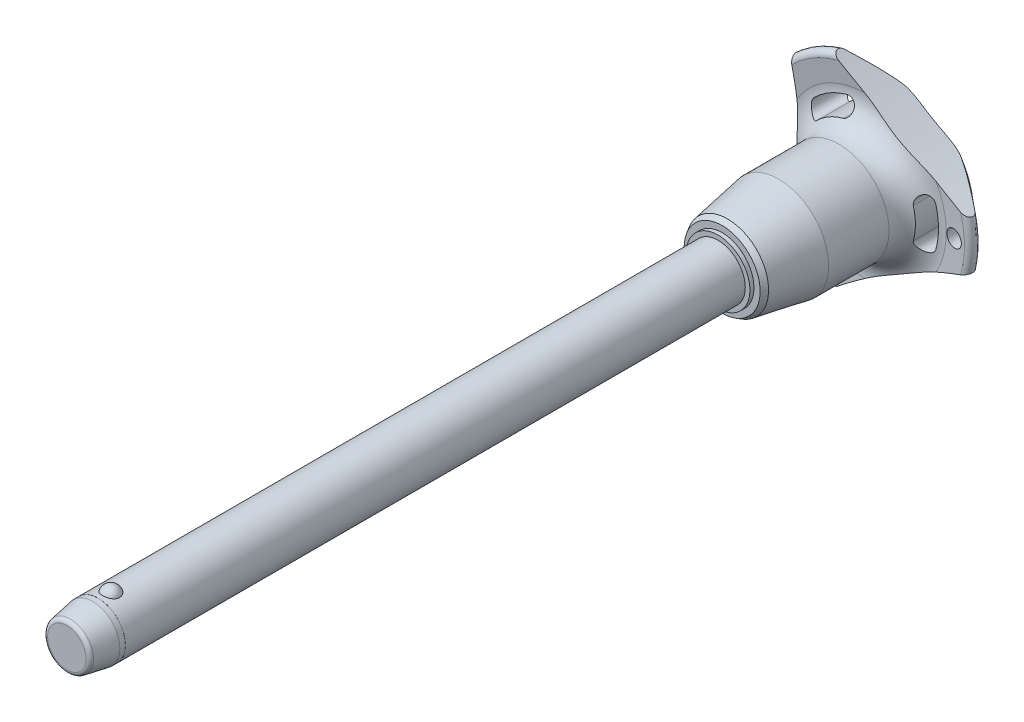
from build123d import *

# Parameters (mm, degrees)
SKETCH1_R           = 5
BOSS_EXTRUDE1_DEPTH = 110
SKETCH2_R           = 4.25
BOSS_EXTRUDE2_DEPTH = 33.3
BOSS_EXTRUDE3_START = 9.6
SKETCH1_2_R         = 5
BOSS_EXTRUDE3_DEPTH = 9.6
CHAMFER1_SIZE       = 4.8
CHAMFER1_SIZE2      = 0.846369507
FILLET1_R           = 0.75
SKETCH6_R           = 102.8
CUT_EXTRUDE1_DEPTH  = 146.959729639
CIRPATTERN1_COUNT   = 3
SKETCH7_R           = 1.5
CUT_EXTRUDE2_DEPTH  = 146.848877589
SKETCH8_R           = 5
SKETCH8_R_2         = 4.99
CUT_EXTRUDE3_DEPTH  = 5.76


with BuildPart() as part:
    # Sketch1 → Boss-Extrude1 (new body)
    with BuildSketch(Plane.XY):
        Circle(SKETCH1_R)
    extrude(amount=-BOSS_EXTRUDE1_DEPTH)

    # Sketch2 → Boss-Extrude2 (add)
    with BuildSketch(Plane(origin=(0, 0, -110), x_dir=(-1, 0, 0), z_dir=(0, 0, -1))):
        Circle(SKETCH2_R)
    extrude(amount=BOSS_EXTRUDE2_DEPTH)

    # Sketch3 → Revolve1 (revolve)
    with BuildSketch(Plane(origin=(0, 0, 0), x_dir=(0, 0, -1), z_dir=(1, 0, 0))):
        with BuildLine():
            Line((-1.516575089, 6), (-1.516575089, 2.7))
            ThreePointArc((-1.516575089, 2.7), (0.133424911, 4.35), (-1.516575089, 6))
        make_face()
        with BuildLine():
            Line((-1.516575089, -2.7), (-1.516575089, -6))
            ThreePointArc((-1.516575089, -6), (0.133424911, -4.35), (-1.516575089, -2.7))
        make_face()
    revolve(axis=Axis((0, -2.7, 1.516575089), (0, 1, 0)))

    # Sketch1_2 → Boss-Extrude3 (add)
    with BuildSketch(Plane.XY.offset(BOSS_EXTRUDE3_START)):
        Circle(SKETCH1_2_R)
    extrude(amount=-BOSS_EXTRUDE3_DEPTH)

    # Chamfer1
    chamfer1_edges = [part.edges().sort_by_distance(p)[0] for p in [
        (-5, 0, 9.6),
    ]]
    chamfer1_side = [part.faces().sort_by_distance(p)[0] for p in [
        (-5, 0, -50.2),
    ]]
    chamfer(chamfer1_edges, length=CHAMFER1_SIZE, length2=CHAMFER1_SIZE2, reference=chamfer1_side[0])

    # Fillet1
    fillet1_edges = [part.edges().sort_by_distance(p)[0] for p in [
        (-4.153630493, 0, 9.6),
        (4.25, 0, -143.3),
    ]]
    fillet(fillet1_edges, radius=FILLET1_R)

    # Sketch4 → Revolve2 (revolve)
    with BuildSketch(Plane(origin=(0, 0, 0), x_dir=(0, 0, -1), z_dir=(1, 0, 0)), mode=Mode.PRIVATE) as revolve2_sk:
        Polygon((110, 0), (110, 5.848880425), (110.75, 5.848880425), (110.75, 6.981619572), (111.730980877, 7.547989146), (121.1, 9.2), (132.2, 9.2), (132.2, 0), align=None)
    revolve(revolve2_sk.sketch.rotate(Axis((0, 0, -132.2), (0, 0, 1)), 90), axis=Axis((0, 0, -132.2), (0, 0, 1)))

    # Sketch5 → Revolve3 (revolve)
    with BuildSketch(Plane(origin=(0, 0, 0), x_dir=(0, 0, -1), z_dir=(1, 0, 0)), mode=Mode.PRIVATE) as revolve3_sk:
        with BuildLine():
            Line((137.169704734, 14.749576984), (136.756059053, 18.490084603))
            ThreePointArc((136.756059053, 18.490084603), (137.35677658, 19.519442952), (138.516044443, 19.24278761))
            Line((138.516044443, 19.24278761), (142.835691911, 14.094832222))
            ThreePointArc((142.835691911, 14.094832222), (143.3, 12.689260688), (142.67067517, 11.349423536))
            ThreePointArc((142.67067517, 11.349423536), (139.033110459, 6.185112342), (137.75, 0))
            Line((137.75, 0), (132.2, 0))
            Line((132.2, 0), (132.2, 9.2))
            ThreePointArc((132.2, 9.2), (135.924774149, 10.864425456), (137.169704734, 14.749576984))
        make_face()
    revolve(revolve3_sk.sketch.rotate(Axis((0, 0, -137.75), (0, 0, 1)), 90), axis=Axis((0, 0, -137.75), (0, 0, 1)))

    # Sketch6 → Cut-Extrude1 (cut, through all)
    with BuildSketch(Plane.XY):
        with Locations((-115.2, 0)):
            Circle(SKETCH6_R)
        with BuildLine():
            ThreePointArc((12.885043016, -3.538869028), (13.362182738, 0), (12.885043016, 3.538869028))
            ThreePointArc((12.885043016, 3.538869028), (11.179749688, 4.509281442), (10.209337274, 2.803988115))
            ThreePointArc((10.209337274, 2.803988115), (10.587394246, 0), (10.209337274, -2.803988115))
            ThreePointArc((10.209337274, -2.803988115), (11.179749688, -4.509281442), (12.885043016, -3.538869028))
        make_face()
    cut_extrude1 = extrude(amount=-CUT_EXTRUDE1_DEPTH, mode=Mode.SUBTRACT)

    # CirPattern1: Cut-Extrude1 ×3 about axis
    cirpattern1_axis = Axis((0, 0, 0), (0, 0, 1))
    for i in range(1, CIRPATTERN1_COUNT):
        add(cut_extrude1.rotate(cirpattern1_axis, i * 360 / CIRPATTERN1_COUNT), mode=Mode.SUBTRACT)

    # Sketch7 → Cut-Extrude2 (cut, through all)
    with BuildSketch(Plane.XY):
        with Locations(Location((16.362182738, 0, 0), (0, 0, 225.449470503))):
            Circle(SKETCH7_R)
    extrude(amount=-CUT_EXTRUDE2_DEPTH, mode=Mode.SUBTRACT)

    # Sketch8 → Cut-Extrude3 (cut)
    with BuildSketch(Plane.XY.offset(9.6)):
        Circle(SKETCH8_R)
        Circle(SKETCH8_R_2, mode=Mode.SUBTRACT)
    extrude(amount=-CUT_EXTRUDE3_DEPTH, mode=Mode.SUBTRACT)


solid = part.part
